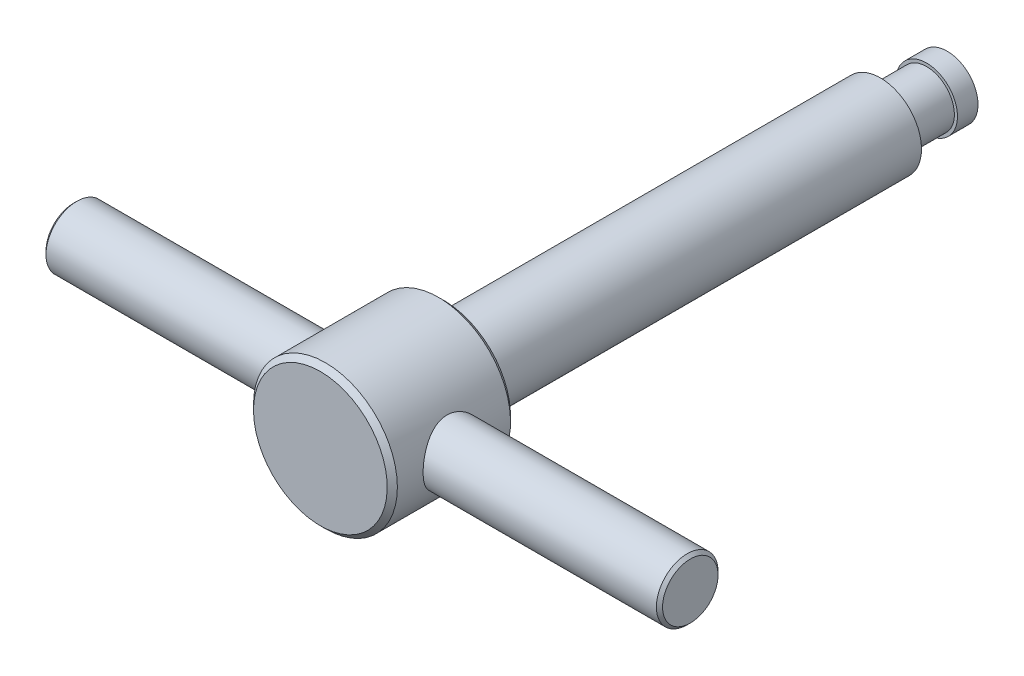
ISO-10303-21;
HEADER;
FILE_DESCRIPTION(('STEP AP214'),'2;1');
FILE_NAME('part.step','',(''),(''),'','','');
FILE_SCHEMA(('AUTOMOTIVE_DESIGN { 1 0 10303 214 1 1 1 1 }'));
ENDSEC;
DATA;
#1=APPLICATION_CONTEXT('core data for automotive mechanical design processes');
#2=APPLICATION_PROTOCOL_DEFINITION('international standard','automotive_design',2000,#1);
#3=PRODUCT_CONTEXT('',#1,'mechanical');
#4=PRODUCT('Part','Part','',(#3));
#5=PRODUCT_RELATED_PRODUCT_CATEGORY('part','',(#4));
#6=PRODUCT_DEFINITION_FORMATION('','',#4);
#7=PRODUCT_DEFINITION_CONTEXT('part definition',#1,'design');
#8=PRODUCT_DEFINITION('design','',#6,#7);
#9=PRODUCT_DEFINITION_SHAPE('','',#8);
#10=(LENGTH_UNIT() NAMED_UNIT(*) SI_UNIT(.MILLI.,.METRE.));
#11=(NAMED_UNIT(*) PLANE_ANGLE_UNIT() SI_UNIT($,.RADIAN.));
#12=(NAMED_UNIT(*) SI_UNIT($,.STERADIAN.) SOLID_ANGLE_UNIT());
#13=UNCERTAINTY_MEASURE_WITH_UNIT(LENGTH_MEASURE(1.E-05),#10,'distance_accuracy_value','');
#14=(GEOMETRIC_REPRESENTATION_CONTEXT(3) GLOBAL_UNCERTAINTY_ASSIGNED_CONTEXT((#13)) GLOBAL_UNIT_ASSIGNED_CONTEXT((#10,
#11,#12)) REPRESENTATION_CONTEXT('',''));
#15=CARTESIAN_POINT('',(0.,0.,0.));
#16=DIRECTION('',(0.,0.,1.));
#17=DIRECTION('',(1.,0.,0.));
#18=AXIS2_PLACEMENT_3D('',#15,#16,#17);
#19=CARTESIAN_POINT('',(30.,0.,58.7));
#20=DIRECTION('',(-1.,0.,0.));
#21=DIRECTION('',(0.,-1.,0.));
#22=AXIS2_PLACEMENT_3D('',#19,#20,#21);
#23=PLANE('',#22);
#24=CARTESIAN_POINT('',(29.9999999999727,0.,56.));
#25=DIRECTION('',(-1.,0.,0.));
#26=DIRECTION('',(0.,-1.,0.));
#27=AXIS2_PLACEMENT_3D('',#24,#25,#26);
#28=CIRCLE('',#27,2.70000000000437);
#29=CARTESIAN_POINT('',(29.9999999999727,-2.70000000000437,56.));
#30=VERTEX_POINT('',#29);
#31=EDGE_CURVE('E15',#30,#30,#28,.T.);
#32=ORIENTED_EDGE('',*,*,#31,.F.);
#33=EDGE_LOOP('',(#32));
#34=FACE_BOUND('',#33,.T.);
#35=ADVANCED_FACE('F12',(#34),#23,.F.);
#36=CARTESIAN_POINT('',(-30.,0.,56.));
#37=DIRECTION('',(1.,0.,0.));
#38=DIRECTION('',(0.,1.,0.));
#39=AXIS2_PLACEMENT_3D('',#36,#37,#38);
#40=PLANE('',#39);
#41=CARTESIAN_POINT('',(-29.9999999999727,0.,56.));
#42=DIRECTION('',(1.,0.,0.));
#43=DIRECTION('',(0.,1.,0.));
#44=AXIS2_PLACEMENT_3D('',#41,#42,#43);
#45=CIRCLE('',#44,2.70000000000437);
#46=CARTESIAN_POINT('',(-29.9999999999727,2.70000000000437,56.));
#47=VERTEX_POINT('',#46);
#48=EDGE_CURVE('E133',#47,#47,#45,.T.);
#49=ORIENTED_EDGE('',*,*,#48,.F.);
#50=EDGE_LOOP('',(#49));
#51=FACE_BOUND('',#50,.T.);
#52=ADVANCED_FACE('F171',(#51),#40,.F.);
#53=CARTESIAN_POINT('',(0.,0.,5.));
#54=DIRECTION('',(-1.,0.,0.));
#55=DIRECTION('',(0.,1.,0.));
#56=AXIS2_PLACEMENT_3D('',#53,#54,#55);
#57=SPHERICAL_SURFACE('',#56,5.);
#58=CARTESIAN_POINT('',(0.,0.,1.));
#59=DIRECTION('',(0.,0.,1.));
#60=DIRECTION('',(0.,-1.,0.));
#61=AXIS2_PLACEMENT_3D('',#58,#59,#60);
#62=CIRCLE('',#61,3.);
#63=CARTESIAN_POINT('',(0.,-3.,1.));
#64=VERTEX_POINT('',#63);
#65=EDGE_CURVE('E126',#64,#64,#62,.T.);
#66=ORIENTED_EDGE('',*,*,#65,.F.);
#67=EDGE_LOOP('',(#66));
#68=FACE_BOUND('',#67,.T.);
#69=ADVANCED_FACE('F168',(#68),#57,.T.);
#70=CARTESIAN_POINT('',(29.6999999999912,0.,56.));
#71=DIRECTION('',(-1.,0.,0.));
#72=DIRECTION('',(0.,-1.,0.));
#73=AXIS2_PLACEMENT_3D('',#70,#71,#72);
#74=CONICAL_SURFACE('',#73,2.99999999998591,0.785398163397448);
#75=CARTESIAN_POINT('',(29.7,0.,56.));
#76=DIRECTION('',(-1.,0.,0.));
#77=DIRECTION('',(0.,-1.,0.));
#78=AXIS2_PLACEMENT_3D('',#75,#76,#77);
#79=CIRCLE('',#78,3.);
#80=CARTESIAN_POINT('',(29.7,-3.,56.));
#81=VERTEX_POINT('',#80);
#82=EDGE_CURVE('E124',#81,#81,#79,.T.);
#83=ORIENTED_EDGE('',*,*,#82,.F.);
#84=EDGE_LOOP('',(#83));
#85=FACE_BOUND('',#84,.T.);
#86=ORIENTED_EDGE('',*,*,#31,.T.);
#87=EDGE_LOOP('',(#86));
#88=FACE_BOUND('',#87,.T.);
#89=ADVANCED_FACE('F164',(#85,#88),#74,.T.);
#90=CARTESIAN_POINT('',(0.,0.,62.));
#91=DIRECTION('',(0.,0.,-1.));
#92=DIRECTION('',(0.,1.,0.));
#93=AXIS2_PLACEMENT_3D('',#90,#91,#92);
#94=PLANE('',#93);
#95=CARTESIAN_POINT('',(0.,0.,61.999999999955));
#96=DIRECTION('',(0.,0.,-1.));
#97=DIRECTION('',(0.,1.,0.));
#98=AXIS2_PLACEMENT_3D('',#95,#96,#97);
#99=CIRCLE('',#98,6.50502525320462);
#100=CARTESIAN_POINT('',(0.,6.50502525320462,61.999999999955));
#101=VERTEX_POINT('',#100);
#102=EDGE_CURVE('E121',#101,#101,#99,.T.);
#103=ORIENTED_EDGE('',*,*,#102,.F.);
#104=EDGE_LOOP('',(#103));
#105=FACE_BOUND('',#104,.T.);
#106=ADVANCED_FACE('F160',(#105),#94,.F.);
#107=CARTESIAN_POINT('',(-29.700000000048,0.,56.));
#108=DIRECTION('',(1.,0.,0.));
#109=DIRECTION('',(0.,1.,0.));
#110=AXIS2_PLACEMENT_3D('',#107,#108,#109);
#111=CONICAL_SURFACE('',#110,2.99999999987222,0.78539816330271);
#112=ORIENTED_EDGE('',*,*,#48,.T.);
#113=EDGE_LOOP('',(#112));
#114=FACE_BOUND('',#113,.T.);
#115=CARTESIAN_POINT('',(-29.7,0.,56.));
#116=DIRECTION('',(-1.,0.,0.));
#117=DIRECTION('',(0.,-1.,0.));
#118=AXIS2_PLACEMENT_3D('',#115,#116,#117);
#119=CIRCLE('',#118,3.);
#120=CARTESIAN_POINT('',(-29.7,-3.,56.));
#121=VERTEX_POINT('',#120);
#122=EDGE_CURVE('E117',#121,#121,#119,.F.);
#123=ORIENTED_EDGE('',*,*,#122,.F.);
#124=EDGE_LOOP('',(#123));
#125=FACE_BOUND('',#124,.T.);
#126=ADVANCED_FACE('F154',(#114,#125),#111,.T.);
#127=CARTESIAN_POINT('',(0.,0.,0.));
#128=DIRECTION('',(0.,0.,1.));
#129=DIRECTION('',(0.,-1.,0.));
#130=AXIS2_PLACEMENT_3D('',#127,#128,#129);
#131=CYLINDRICAL_SURFACE('',#130,3.);
#132=CARTESIAN_POINT('',(0.,0.,3.));
#133=DIRECTION('',(0.,0.,1.));
#134=DIRECTION('',(0.,-1.,0.));
#135=AXIS2_PLACEMENT_3D('',#132,#133,#134);
#136=CIRCLE('',#135,3.);
#137=CARTESIAN_POINT('',(0.,-3.,3.));
#138=VERTEX_POINT('',#137);
#139=EDGE_CURVE('E120',#138,#138,#136,.F.);
#140=ORIENTED_EDGE('',*,*,#139,.T.);
#141=EDGE_LOOP('',(#140));
#142=FACE_BOUND('',#141,.T.);
#143=ORIENTED_EDGE('',*,*,#65,.T.);
#144=EDGE_LOOP('',(#143));
#145=FACE_BOUND('',#144,.T.);
#146=ADVANCED_FACE('F147',(#142,#145),#131,.T.);
#147=CARTESIAN_POINT('',(30.,0.,56.));
#148=DIRECTION('',(-1.,0.,0.));
#149=DIRECTION('',(0.,-1.,0.));
#150=AXIS2_PLACEMENT_3D('',#147,#148,#149);
#151=CYLINDRICAL_SURFACE('',#150,3.);
#152=CARTESIAN_POINT('',(6.32634555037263,2.99622295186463,55.8495073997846));
#153=CARTESIAN_POINT('',(6.32826447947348,2.99217213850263,55.7688757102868));
#154=CARTESIAN_POINT('',(6.33172535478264,2.98486151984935,55.6884118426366));
#155=CARTESIAN_POINT('',(6.34160222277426,2.96381632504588,55.5284968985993));
#156=CARTESIAN_POINT('',(6.34802020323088,2.95007742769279,55.4490465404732));
#157=CARTESIAN_POINT('',(6.3714403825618,2.89934380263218,55.2127740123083));
#158=CARTESIAN_POINT('',(6.39260177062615,2.85284537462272,55.0582841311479));
#159=CARTESIAN_POINT('',(6.44315888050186,2.73672071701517,54.7607182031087));
#160=CARTESIAN_POINT('',(6.47251695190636,2.66719997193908,54.6175937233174));
#161=CARTESIAN_POINT('',(6.53618130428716,2.50713763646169,54.3449352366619));
#162=CARTESIAN_POINT('',(6.57048627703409,2.41660159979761,54.2153976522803));
#163=CARTESIAN_POINT('',(6.64282052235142,2.21033740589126,53.964715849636));
#164=CARTESIAN_POINT('',(6.68094850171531,2.09338697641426,53.844604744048));
#165=CARTESIAN_POINT('',(6.75493795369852,1.84068917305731,53.6251585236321));
#166=CARTESIAN_POINT('',(6.79079872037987,1.70493598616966,53.5258298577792));
#167=CARTESIAN_POINT('',(6.85745262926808,1.41359734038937,53.3482779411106));
#168=CARTESIAN_POINT('',(6.88807643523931,1.25756417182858,53.270720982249));
#169=CARTESIAN_POINT('',(6.93948106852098,0.933018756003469,53.1434624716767));
#170=CARTESIAN_POINT('',(6.96026753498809,0.764513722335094,53.0937449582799));
#171=CARTESIAN_POINT('',(6.98854168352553,0.431666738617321,53.0266901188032));
#172=CARTESIAN_POINT('',(6.99681179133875,0.267775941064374,53.0074438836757));
#173=CARTESIAN_POINT('',(7.001662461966,-0.0610911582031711,52.996117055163));
#174=CARTESIAN_POINT('',(6.9982467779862,-0.226067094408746,53.0040277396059));
#175=CARTESIAN_POINT('',(6.98061410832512,-0.543036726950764,53.0454634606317));
#176=CARTESIAN_POINT('',(6.966989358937,-0.695250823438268,53.0775846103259));
#177=CARTESIAN_POINT('',(6.93097400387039,-0.991940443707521,53.1645177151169));
#178=CARTESIAN_POINT('',(6.90858231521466,-1.13641500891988,53.2193324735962));
#179=CARTESIAN_POINT('',(6.85631790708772,-1.41849030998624,53.3518112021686));
#180=CARTESIAN_POINT('',(6.8262389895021,-1.5557499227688,53.4301174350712));
#181=CARTESIAN_POINT('',(6.76175360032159,-1.81566779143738,53.6066635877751));
#182=CARTESIAN_POINT('',(6.72734530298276,-1.93831984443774,53.7049119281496));
#183=CARTESIAN_POINT('',(6.65467138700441,-2.17528088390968,53.9272021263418));
#184=CARTESIAN_POINT('',(6.61631054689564,-2.28826342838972,54.052630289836));
#185=CARTESIAN_POINT('',(6.54230506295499,-2.49199129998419,54.3211920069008));
#186=CARTESIAN_POINT('',(6.50666120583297,-2.58273020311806,54.4643306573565));
#187=CARTESIAN_POINT('',(6.44169002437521,-2.7408216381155,54.7680339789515));
#188=CARTESIAN_POINT('',(6.4124965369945,-2.80769373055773,54.9288795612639));
#189=CARTESIAN_POINT('',(6.36544592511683,-2.91281204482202,55.2611995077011));
#190=CARTESIAN_POINT('',(6.34757878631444,-2.9510835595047,55.4326643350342));
#191=CARTESIAN_POINT('',(6.32684241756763,-2.99526422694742,55.7666222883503));
#192=CARTESIAN_POINT('',(6.32289024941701,-3.00351193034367,55.9287396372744));
#193=CARTESIAN_POINT('',(6.32751135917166,-2.99376571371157,56.2519835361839));
#194=CARTESIAN_POINT('',(6.33608227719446,-2.97577673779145,56.4131102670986));
#195=CARTESIAN_POINT('',(6.36375836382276,-2.91608676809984,56.7209155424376));
#196=CARTESIAN_POINT('',(6.3822785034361,-2.87569894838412,56.8679066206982));
#197=CARTESIAN_POINT('',(6.42725603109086,-2.77371031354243,57.1530275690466));
#198=CARTESIAN_POINT('',(6.45371556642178,-2.71210375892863,57.2911550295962));
#199=CARTESIAN_POINT('',(6.51358659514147,-2.56512033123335,57.5638388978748));
#200=CARTESIAN_POINT('',(6.54732342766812,-2.47852390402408,57.6976650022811));
#201=CARTESIAN_POINT('',(6.61712783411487,-2.28563635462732,57.9496322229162));
#202=CARTESIAN_POINT('',(6.65319650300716,-2.17933593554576,58.0677658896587));
#203=CARTESIAN_POINT('',(6.72705004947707,-1.94001961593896,58.2946952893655));
#204=CARTESIAN_POINT('',(6.76474236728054,-1.80554916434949,58.4019947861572));
#205=CARTESIAN_POINT('',(6.83473227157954,-1.51925001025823,58.5925733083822));
#206=CARTESIAN_POINT('',(6.86703025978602,-1.36742260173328,58.6758541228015));
#207=CARTESIAN_POINT('',(6.9222349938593,-1.05252985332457,58.8144861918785));
#208=CARTESIAN_POINT('',(6.94526981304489,-0.889656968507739,58.870220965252));
#209=CARTESIAN_POINT('',(6.97992599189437,-0.555653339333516,58.9531009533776));
#210=CARTESIAN_POINT('',(6.99155445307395,-0.384527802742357,58.9802639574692));
#211=CARTESIAN_POINT('',(7.00161796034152,-0.0528390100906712,59.0037879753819));
#212=CARTESIAN_POINT('',(7.00098365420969,0.107545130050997,59.0023216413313));
#213=CARTESIAN_POINT('',(6.98886077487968,0.425608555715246,58.9739436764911));
#214=CARTESIAN_POINT('',(6.97737328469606,0.583288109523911,58.9470345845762));
#215=CARTESIAN_POINT('',(6.94513836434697,0.887657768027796,58.8698659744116));
#216=CARTESIAN_POINT('',(6.92462231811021,1.0345216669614,58.8201887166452));
#217=CARTESIAN_POINT('',(6.87632878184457,1.31787046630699,58.6994354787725));
#218=CARTESIAN_POINT('',(6.84854960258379,1.45435294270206,58.6283545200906));
#219=CARTESIAN_POINT('',(6.78647151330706,1.7215339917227,58.4622072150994));
#220=CARTESIAN_POINT('',(6.75189125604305,1.85145959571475,58.3660047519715));
#221=CARTESIAN_POINT('',(6.68066929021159,2.09395764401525,58.1543583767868));
#222=CARTESIAN_POINT('',(6.64402670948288,2.20652267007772,58.0389062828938));
#223=CARTESIAN_POINT('',(6.56984841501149,2.41879434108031,57.7829464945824));
#224=CARTESIAN_POINT('',(6.53241556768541,2.51714659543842,57.6412826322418));
#225=CARTESIAN_POINT('',(6.46370144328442,2.68870997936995,57.341846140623));
#226=CARTESIAN_POINT('',(6.43242233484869,2.76191225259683,57.184067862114));
#227=CARTESIAN_POINT('',(6.39360961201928,2.85004205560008,56.9404988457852));
#228=CARTESIAN_POINT('',(6.38210422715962,2.87564429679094,56.8590623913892));
#229=CARTESIAN_POINT('',(6.36199032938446,2.91987586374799,56.6939817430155));
#230=CARTESIAN_POINT('',(6.35338035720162,2.9385087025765,56.6103386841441));
#231=CARTESIAN_POINT('',(6.33940677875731,2.9685341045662,56.4417284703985));
#232=CARTESIAN_POINT('',(6.33403480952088,2.97994532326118,56.3567653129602));
#233=CARTESIAN_POINT('',(6.32671830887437,2.99544842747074,56.1860694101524));
#234=CARTESIAN_POINT('',(6.32477116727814,2.99954588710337,56.1003373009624));
#235=CARTESIAN_POINT('',(6.32450831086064,3.00009880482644,55.9870854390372));
#236=CARTESIAN_POINT('',(6.32462478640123,2.99985362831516,55.9595527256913));
#237=CARTESIAN_POINT('',(6.32521628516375,2.99860624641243,55.9045093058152));
#238=CARTESIAN_POINT('',(6.32569129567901,2.99760406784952,55.8769985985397));
#239=CARTESIAN_POINT('',(6.32634555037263,2.99622295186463,55.8495073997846));
#240=B_SPLINE_CURVE_WITH_KNOTS('',3,(#152,#153,#154,#155,#156,#157,#158,#159,#160,#161,#162,
#163,#164,#165,#166,#167,#168,#169,#170,#171,#172,#173,#174,#175,#176,#177,#178,#179,#180,#181,
#182,#183,#184,#185,#186,#187,#188,#189,#190,#191,#192,#193,#194,#195,#196,#197,#198,#199,#200,
#201,#202,#203,#204,#205,#206,#207,#208,#209,#210,#211,#212,#213,#214,#215,#216,#217,#218,#219,
#220,#221,#222,#223,#224,#225,#226,#227,#228,#229,#230,#231,#232,#233,#234,#235,#236,#237,#238,
#239),.UNSPECIFIED.,.T.,.F.,(4,2,2,2,2,2,2,2,2,2,2,2,2,2,2,2,2,2,2,2,2,2,2,2,2,2,2,2,2,2,2,2,2,
2,2,2,2,2,2,2,2,2,2,4),(0.,0.242237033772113,0.484637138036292,0.970189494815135,
1.45354721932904,1.9367773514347,2.45025889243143,2.96389953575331,3.49187330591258,
4.01954405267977,4.5126256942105,5.00554898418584,5.4718982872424,5.93830521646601,
6.41885040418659,6.8995989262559,7.41659728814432,7.93374478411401,8.4607824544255,
8.9873534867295,9.47190919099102,9.95637359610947,10.4150497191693,10.8738500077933,
11.3606033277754,11.8475868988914,12.3734108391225,12.8991956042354,13.4174378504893,
13.9353572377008,14.4141361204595,14.8928672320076,15.3599854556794,15.8272124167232,
16.3210681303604,16.8151342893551,17.3420827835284,17.8692166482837,18.1273357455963,
18.3853245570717,18.6426441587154,18.8997675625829,18.9823606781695,19.064950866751),.UNSPECIFIED.);
#241=CARTESIAN_POINT('',(6.32634555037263,2.99622295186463,55.8495073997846));
#242=VERTEX_POINT('',#241);
#243=EDGE_CURVE('E46',#242,#242,#240,.T.);
#244=ORIENTED_EDGE('',*,*,#243,.F.);
#245=EDGE_LOOP('',(#244));
#246=FACE_BOUND('',#245,.T.);
#247=ORIENTED_EDGE('',*,*,#82,.T.);
#248=EDGE_LOOP('',(#247));
#249=FACE_BOUND('',#248,.T.);
#250=ADVANCED_FACE('F145',(#246,#249),#151,.T.);
#251=CARTESIAN_POINT('',(0.,0.,61.5050252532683));
#252=DIRECTION('',(0.,0.,-1.));
#253=DIRECTION('',(0.,1.,0.));
#254=AXIS2_PLACEMENT_3D('',#251,#252,#253);
#255=CONICAL_SURFACE('',#254,6.99999999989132,0.785398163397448);
#256=ORIENTED_EDGE('',*,*,#102,.T.);
#257=EDGE_LOOP('',(#256));
#258=FACE_BOUND('',#257,.T.);
#259=CARTESIAN_POINT('',(0.,0.,61.5050252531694));
#260=DIRECTION('',(0.,0.,1.));
#261=DIRECTION('',(0.,-1.,0.));
#262=AXIS2_PLACEMENT_3D('',#259,#260,#261);
#263=CIRCLE('',#262,7.);
#264=CARTESIAN_POINT('',(0.,-7.,61.5050252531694));
#265=VERTEX_POINT('',#264);
#266=EDGE_CURVE('E45',#265,#265,#263,.F.);
#267=ORIENTED_EDGE('',*,*,#266,.F.);
#268=EDGE_LOOP('',(#267));
#269=FACE_BOUND('',#268,.T.);
#270=ADVANCED_FACE('F72',(#258,#269),#255,.T.);
#271=CARTESIAN_POINT('',(30.,0.,56.));
#272=DIRECTION('',(-1.,0.,0.));
#273=DIRECTION('',(0.,-1.,0.));
#274=AXIS2_PLACEMENT_3D('',#271,#272,#273);
#275=CYLINDRICAL_SURFACE('',#274,3.);
#276=ORIENTED_EDGE('',*,*,#122,.T.);
#277=EDGE_LOOP('',(#276));
#278=FACE_BOUND('',#277,.T.);
#279=CARTESIAN_POINT('',(-6.32634555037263,2.99622295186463,56.1504926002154));
#280=CARTESIAN_POINT('',(-6.32826447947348,2.99217213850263,56.2311242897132));
#281=CARTESIAN_POINT('',(-6.33172535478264,2.98486151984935,56.3115881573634));
#282=CARTESIAN_POINT('',(-6.34160222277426,2.96381632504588,56.4715031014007));
#283=CARTESIAN_POINT('',(-6.34802020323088,2.95007742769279,56.5509534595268));
#284=CARTESIAN_POINT('',(-6.3714403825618,2.89934380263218,56.7872259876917));
#285=CARTESIAN_POINT('',(-6.39260177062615,2.85284537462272,56.9417158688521));
#286=CARTESIAN_POINT('',(-6.44315888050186,2.73672071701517,57.2392817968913));
#287=CARTESIAN_POINT('',(-6.47251695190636,2.66719997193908,57.3824062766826));
#288=CARTESIAN_POINT('',(-6.53618130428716,2.5071376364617,57.6550647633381));
#289=CARTESIAN_POINT('',(-6.57048627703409,2.41660159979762,57.7846023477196));
#290=CARTESIAN_POINT('',(-6.64282052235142,2.21033740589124,58.035284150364));
#291=CARTESIAN_POINT('',(-6.68094850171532,2.09338697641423,58.1553952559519));
#292=CARTESIAN_POINT('',(-6.75493795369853,1.84068917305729,58.3748414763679));
#293=CARTESIAN_POINT('',(-6.79079872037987,1.70493598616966,58.4741701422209));
#294=CARTESIAN_POINT('',(-6.85745262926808,1.41359734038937,58.6517220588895));
#295=CARTESIAN_POINT('',(-6.88807643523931,1.25756417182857,58.729279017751));
#296=CARTESIAN_POINT('',(-6.93948106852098,0.933018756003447,58.8565375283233));
#297=CARTESIAN_POINT('',(-6.96026753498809,0.764513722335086,58.9062550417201));
#298=CARTESIAN_POINT('',(-6.98854168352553,0.431666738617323,58.9733098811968));
#299=CARTESIAN_POINT('',(-6.99681179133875,0.267775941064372,58.9925561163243));
#300=CARTESIAN_POINT('',(-7.001662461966,-0.061091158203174,59.003882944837));
#301=CARTESIAN_POINT('',(-6.9982467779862,-0.226067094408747,58.9959722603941));
#302=CARTESIAN_POINT('',(-6.98061410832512,-0.543036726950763,58.9545365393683));
#303=CARTESIAN_POINT('',(-6.966989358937,-0.695250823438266,58.9224153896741));
#304=CARTESIAN_POINT('',(-6.93097400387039,-0.991940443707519,58.8354822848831));
#305=CARTESIAN_POINT('',(-6.90858231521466,-1.13641500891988,58.7806675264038));
#306=CARTESIAN_POINT('',(-6.85631790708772,-1.41849030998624,58.6481887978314));
#307=CARTESIAN_POINT('',(-6.8262389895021,-1.5557499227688,58.5698825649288));
#308=CARTESIAN_POINT('',(-6.76175360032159,-1.81566779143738,58.393336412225));
#309=CARTESIAN_POINT('',(-6.72734530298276,-1.93831984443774,58.2950880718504));
#310=CARTESIAN_POINT('',(-6.65467138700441,-2.17528088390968,58.0727978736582));
#311=CARTESIAN_POINT('',(-6.61631054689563,-2.28826342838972,57.947369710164));
#312=CARTESIAN_POINT('',(-6.54230506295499,-2.49199129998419,57.6788079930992));
#313=CARTESIAN_POINT('',(-6.50666120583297,-2.58273020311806,57.5356693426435));
#314=CARTESIAN_POINT('',(-6.44169002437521,-2.7408216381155,57.2319660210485));
#315=CARTESIAN_POINT('',(-6.4124965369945,-2.80769373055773,57.0711204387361));
#316=CARTESIAN_POINT('',(-6.36544592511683,-2.91281204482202,56.7388004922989));
#317=CARTESIAN_POINT('',(-6.34757878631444,-2.9510835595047,56.5673356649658));
#318=CARTESIAN_POINT('',(-6.32684241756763,-2.99526422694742,56.2333777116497));
#319=CARTESIAN_POINT('',(-6.32289024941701,-3.00351193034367,56.0712603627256));
#320=CARTESIAN_POINT('',(-6.32751135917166,-2.99376571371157,55.7480164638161));
#321=CARTESIAN_POINT('',(-6.33608227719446,-2.97577673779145,55.5868897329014));
#322=CARTESIAN_POINT('',(-6.36375836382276,-2.91608676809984,55.2790844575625));
#323=CARTESIAN_POINT('',(-6.3822785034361,-2.87569894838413,55.1320933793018));
#324=CARTESIAN_POINT('',(-6.42725603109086,-2.77371031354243,54.8469724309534));
#325=CARTESIAN_POINT('',(-6.45371556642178,-2.71210375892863,54.7088449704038));
#326=CARTESIAN_POINT('',(-6.51358659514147,-2.56512033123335,54.4361611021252));
#327=CARTESIAN_POINT('',(-6.54732342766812,-2.47852390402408,54.3023349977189));
#328=CARTESIAN_POINT('',(-6.61712783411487,-2.28563635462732,54.0503677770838));
#329=CARTESIAN_POINT('',(-6.65319650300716,-2.17933593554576,53.9322341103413));
#330=CARTESIAN_POINT('',(-6.72705004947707,-1.94001961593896,53.7053047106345));
#331=CARTESIAN_POINT('',(-6.76474236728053,-1.80554916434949,53.5980052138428));
#332=CARTESIAN_POINT('',(-6.83473227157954,-1.51925001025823,53.4074266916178));
#333=CARTESIAN_POINT('',(-6.86703025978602,-1.36742260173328,53.3241458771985));
#334=CARTESIAN_POINT('',(-6.9222349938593,-1.05252985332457,53.1855138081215));
#335=CARTESIAN_POINT('',(-6.94526981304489,-0.889656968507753,53.129779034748));
#336=CARTESIAN_POINT('',(-6.97992599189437,-0.555653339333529,53.0468990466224));
#337=CARTESIAN_POINT('',(-6.99155445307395,-0.384527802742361,53.019736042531));
#338=CARTESIAN_POINT('',(-7.00161796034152,-0.0528390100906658,52.9962120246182));
#339=CARTESIAN_POINT('',(-7.00098365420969,0.107545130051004,52.9976783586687));
#340=CARTESIAN_POINT('',(-6.98886077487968,0.42560855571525,53.0260563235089));
#341=CARTESIAN_POINT('',(-6.97737328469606,0.583288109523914,53.0529654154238));
#342=CARTESIAN_POINT('',(-6.94513836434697,0.887657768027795,53.1301340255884));
#343=CARTESIAN_POINT('',(-6.92462231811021,1.03452166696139,53.1798112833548));
#344=CARTESIAN_POINT('',(-6.87632878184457,1.31787046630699,53.3005645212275));
#345=CARTESIAN_POINT('',(-6.84854960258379,1.45435294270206,53.3716454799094));
#346=CARTESIAN_POINT('',(-6.78647151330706,1.7215339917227,53.5377927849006));
#347=CARTESIAN_POINT('',(-6.75189125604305,1.85145959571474,53.6339952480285));
#348=CARTESIAN_POINT('',(-6.68066929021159,2.09395764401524,53.8456416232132));
#349=CARTESIAN_POINT('',(-6.64402670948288,2.20652267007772,53.9610937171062));
#350=CARTESIAN_POINT('',(-6.56984841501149,2.41879434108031,54.2170535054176));
#351=CARTESIAN_POINT('',(-6.53241556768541,2.51714659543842,54.3587173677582));
#352=CARTESIAN_POINT('',(-6.46370144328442,2.68870997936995,54.658153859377));
#353=CARTESIAN_POINT('',(-6.43242233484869,2.76191225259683,54.815932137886));
#354=CARTESIAN_POINT('',(-6.39360961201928,2.85004205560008,55.0595011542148));
#355=CARTESIAN_POINT('',(-6.38210422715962,2.87564429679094,55.1409376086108));
#356=CARTESIAN_POINT('',(-6.36199032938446,2.91987586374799,55.3060182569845));
#357=CARTESIAN_POINT('',(-6.35338035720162,2.9385087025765,55.3896613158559));
#358=CARTESIAN_POINT('',(-6.33940677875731,2.9685341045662,55.5582715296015));
#359=CARTESIAN_POINT('',(-6.33403480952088,2.97994532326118,55.6432346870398));
#360=CARTESIAN_POINT('',(-6.32671830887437,2.99544842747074,55.8139305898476));
#361=CARTESIAN_POINT('',(-6.32477116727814,2.99954588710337,55.8996626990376));
#362=CARTESIAN_POINT('',(-6.32450831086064,3.00009880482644,56.0129145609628));
#363=CARTESIAN_POINT('',(-6.32462478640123,2.99985362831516,56.0404472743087));
#364=CARTESIAN_POINT('',(-6.32521628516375,2.99860624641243,56.0954906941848));
#365=CARTESIAN_POINT('',(-6.32569129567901,2.99760406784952,56.1230014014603));
#366=CARTESIAN_POINT('',(-6.32634555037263,2.99622295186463,56.1504926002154));
#367=B_SPLINE_CURVE_WITH_KNOTS('',3,(#279,#280,#281,#282,#283,#284,#285,#286,#287,#288,#289,
#290,#291,#292,#293,#294,#295,#296,#297,#298,#299,#300,#301,#302,#303,#304,#305,#306,#307,#308,
#309,#310,#311,#312,#313,#314,#315,#316,#317,#318,#319,#320,#321,#322,#323,#324,#325,#326,#327,
#328,#329,#330,#331,#332,#333,#334,#335,#336,#337,#338,#339,#340,#341,#342,#343,#344,#345,#346,
#347,#348,#349,#350,#351,#352,#353,#354,#355,#356,#357,#358,#359,#360,#361,#362,#363,#364,#365,
#366),.UNSPECIFIED.,.T.,.F.,(4,2,2,2,2,2,2,2,2,2,2,2,2,2,2,2,2,2,2,2,2,2,2,2,2,2,2,2,2,2,2,2,2,
2,2,2,2,2,2,2,2,2,2,4),(0.,0.242237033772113,0.484637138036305,0.970189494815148,
1.45354721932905,1.93677735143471,2.45025889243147,2.96389953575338,3.49187330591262,
4.0195440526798,4.51262569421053,5.00554898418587,5.47189828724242,5.93830521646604,
6.41885040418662,6.89959892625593,7.41659728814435,7.93374478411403,8.46078245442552,
8.98735348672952,9.47190919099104,9.95637359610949,10.4150497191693,10.8738500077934,
11.3606033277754,11.8475868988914,12.3734108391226,12.8991956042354,13.4174378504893,
13.9353572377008,14.4141361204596,14.8928672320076,15.3599854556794,15.8272124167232,
16.3210681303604,16.8151342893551,17.3420827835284,17.8692166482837,18.1273357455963,
18.3853245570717,18.6426441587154,18.8997675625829,18.9823606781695,19.064950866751),.UNSPECIFIED.);
#368=CARTESIAN_POINT('',(-6.32634555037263,2.99622295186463,56.1504926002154));
#369=VERTEX_POINT('',#368);
#370=EDGE_CURVE('E37',#369,#369,#367,.T.);
#371=ORIENTED_EDGE('',*,*,#370,.F.);
#372=EDGE_LOOP('',(#371));
#373=FACE_BOUND('',#372,.T.);
#374=ADVANCED_FACE('F52',(#278,#373),#275,.T.);
#375=CARTESIAN_POINT('',(2.7,0.,3.));
#376=DIRECTION('',(0.,0.,-1.));
#377=DIRECTION('',(0.,1.,0.));
#378=AXIS2_PLACEMENT_3D('',#375,#376,#377);
#379=PLANE('',#378);
#380=CARTESIAN_POINT('',(0.,0.,3.));
#381=DIRECTION('',(0.,0.,1.));
#382=DIRECTION('',(0.,-1.,0.));
#383=AXIS2_PLACEMENT_3D('',#380,#381,#382);
#384=CIRCLE('',#383,2.7);
#385=CARTESIAN_POINT('',(0.,-2.7,3.));
#386=VERTEX_POINT('',#385);
#387=EDGE_CURVE('E33',#386,#386,#384,.T.);
#388=ORIENTED_EDGE('',*,*,#387,.F.);
#389=EDGE_LOOP('',(#388));
#390=FACE_BOUND('',#389,.T.);
#391=ORIENTED_EDGE('',*,*,#139,.F.);
#392=EDGE_LOOP('',(#391));
#393=FACE_BOUND('',#392,.T.);
#394=ADVANCED_FACE('F61',(#390,#393),#379,.F.);
#395=CARTESIAN_POINT('',(0.,0.,0.));
#396=DIRECTION('',(0.,0.,1.));
#397=DIRECTION('',(0.,-1.,0.));
#398=AXIS2_PLACEMENT_3D('',#395,#396,#397);
#399=CYLINDRICAL_SURFACE('',#398,7.);
#400=ORIENTED_EDGE('',*,*,#370,.T.);
#401=EDGE_LOOP('',(#400));
#402=FACE_BOUND('',#401,.T.);
#403=ORIENTED_EDGE('',*,*,#266,.T.);
#404=EDGE_LOOP('',(#403));
#405=FACE_BOUND('',#404,.T.);
#406=ORIENTED_EDGE('',*,*,#243,.T.);
#407=EDGE_LOOP('',(#406));
#408=FACE_BOUND('',#407,.T.);
#409=CARTESIAN_POINT('',(0.,0.,50.4949747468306));
#410=DIRECTION('',(0.,0.,1.));
#411=DIRECTION('',(0.,-1.,0.));
#412=AXIS2_PLACEMENT_3D('',#409,#410,#411);
#413=CIRCLE('',#412,7.);
#414=CARTESIAN_POINT('',(0.,-7.,50.4949747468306));
#415=VERTEX_POINT('',#414);
#416=EDGE_CURVE('E36',#415,#415,#413,.F.);
#417=ORIENTED_EDGE('',*,*,#416,.F.);
#418=EDGE_LOOP('',(#417));
#419=FACE_BOUND('',#418,.T.);
#420=ADVANCED_FACE('F56',(#402,#405,#408,#419),#399,.T.);
#421=CARTESIAN_POINT('',(0.,0.,0.));
#422=DIRECTION('',(0.,0.,1.));
#423=DIRECTION('',(0.,-1.,0.));
#424=AXIS2_PLACEMENT_3D('',#421,#422,#423);
#425=CYLINDRICAL_SURFACE('',#424,2.7);
#426=CARTESIAN_POINT('',(0.,0.,6.74944465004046));
#427=DIRECTION('',(0.,0.,1.));
#428=DIRECTION('',(0.,-1.,0.));
#429=AXIS2_PLACEMENT_3D('',#426,#427,#428);
#430=CIRCLE('',#429,2.69999999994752);
#431=CARTESIAN_POINT('',(0.,-2.69999999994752,6.74944465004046));
#432=VERTEX_POINT('',#431);
#433=EDGE_CURVE('E32',#432,#432,#430,.T.);
#434=ORIENTED_EDGE('',*,*,#433,.F.);
#435=EDGE_LOOP('',(#434));
#436=FACE_BOUND('',#435,.T.);
#437=ORIENTED_EDGE('',*,*,#387,.T.);
#438=EDGE_LOOP('',(#437));
#439=FACE_BOUND('',#438,.T.);
#440=ADVANCED_FACE('F60',(#436,#439),#425,.T.);
#441=CARTESIAN_POINT('',(0.,0.,50.4949747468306));
#442=DIRECTION('',(0.,0.,1.));
#443=DIRECTION('',(-1.,0.,0.));
#444=AXIS2_PLACEMENT_3D('',#441,#442,#443);
#445=CONICAL_SURFACE('',#444,7.,0.785398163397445);
#446=ORIENTED_EDGE('',*,*,#416,.T.);
#447=EDGE_LOOP('',(#446));
#448=FACE_BOUND('',#447,.T.);
#449=CARTESIAN_POINT('',(0.,0.,50.));
#450=DIRECTION('',(0.,0.,1.));
#451=DIRECTION('',(-1.,0.,0.));
#452=AXIS2_PLACEMENT_3D('',#449,#450,#451);
#453=CIRCLE('',#452,6.50502525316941);
#454=CARTESIAN_POINT('',(-6.50502525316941,0.,50.));
#455=VERTEX_POINT('',#454);
#456=EDGE_CURVE('E24',#455,#455,#453,.T.);
#457=ORIENTED_EDGE('',*,*,#456,.T.);
#458=EDGE_LOOP('',(#457));
#459=FACE_BOUND('',#458,.T.);
#460=ADVANCED_FACE('F90',(#448,#459),#445,.T.);
#461=CARTESIAN_POINT('',(0.,0.,7.49999999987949));
#462=DIRECTION('',(0.,0.,1.));
#463=DIRECTION('',(-1.,0.,0.));
#464=AXIS2_PLACEMENT_3D('',#461,#462,#463);
#465=CONICAL_SURFACE('',#464,3.99999999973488,1.04719755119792);
#466=CARTESIAN_POINT('',(0.,0.,7.5));
#467=DIRECTION('',(0.,0.,1.));
#468=DIRECTION('',(0.,-1.,0.));
#469=AXIS2_PLACEMENT_3D('',#466,#467,#468);
#470=CIRCLE('',#469,4.);
#471=CARTESIAN_POINT('',(0.,-4.,7.5));
#472=VERTEX_POINT('',#471);
#473=EDGE_CURVE('E19',#472,#472,#470,.T.);
#474=ORIENTED_EDGE('',*,*,#473,.F.);
#475=EDGE_LOOP('',(#474));
#476=FACE_BOUND('',#475,.T.);
#477=ORIENTED_EDGE('',*,*,#433,.T.);
#478=EDGE_LOOP('',(#477));
#479=FACE_BOUND('',#478,.T.);
#480=ADVANCED_FACE('F84',(#476,#479),#465,.T.);
#481=CARTESIAN_POINT('',(6.50502525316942,0.,50.));
#482=DIRECTION('',(0.,0.,1.));
#483=DIRECTION('',(0.,-1.,0.));
#484=AXIS2_PLACEMENT_3D('',#481,#482,#483);
#485=PLANE('',#484);
#486=ORIENTED_EDGE('',*,*,#456,.F.);
#487=EDGE_LOOP('',(#486));
#488=FACE_BOUND('',#487,.T.);
#489=CARTESIAN_POINT('',(0.,0.,50.));
#490=DIRECTION('',(0.,0.,1.));
#491=DIRECTION('',(0.,-1.,0.));
#492=AXIS2_PLACEMENT_3D('',#489,#490,#491);
#493=CIRCLE('',#492,4.);
#494=CARTESIAN_POINT('',(0.,-4.,50.));
#495=VERTEX_POINT('',#494);
#496=EDGE_CURVE('E8',#495,#495,#493,.F.);
#497=ORIENTED_EDGE('',*,*,#496,.F.);
#498=EDGE_LOOP('',(#497));
#499=FACE_BOUND('',#498,.T.);
#500=ADVANCED_FACE('F78',(#488,#499),#485,.F.);
#501=CARTESIAN_POINT('',(0.,0.,0.));
#502=DIRECTION('',(0.,0.,1.));
#503=DIRECTION('',(0.,-1.,0.));
#504=AXIS2_PLACEMENT_3D('',#501,#502,#503);
#505=CYLINDRICAL_SURFACE('',#504,4.);
#506=ORIENTED_EDGE('',*,*,#496,.T.);
#507=EDGE_LOOP('',(#506));
#508=FACE_BOUND('',#507,.T.);
#509=ORIENTED_EDGE('',*,*,#473,.T.);
#510=EDGE_LOOP('',(#509));
#511=FACE_BOUND('',#510,.T.);
#512=ADVANCED_FACE('F76',(#508,#511),#505,.T.);
#513=CLOSED_SHELL('',(#35,#52,#69,#89,#106,#126,#146,#250,#270,#374,#394,#420,#440,#460,#480,
#500,#512));
#514=MANIFOLD_SOLID_BREP('B1',#513);
#515=ADVANCED_BREP_SHAPE_REPRESENTATION('',(#18,#514),#14);
#516=SHAPE_DEFINITION_REPRESENTATION(#9,#515);
ENDSEC;
END-ISO-10303-21;
